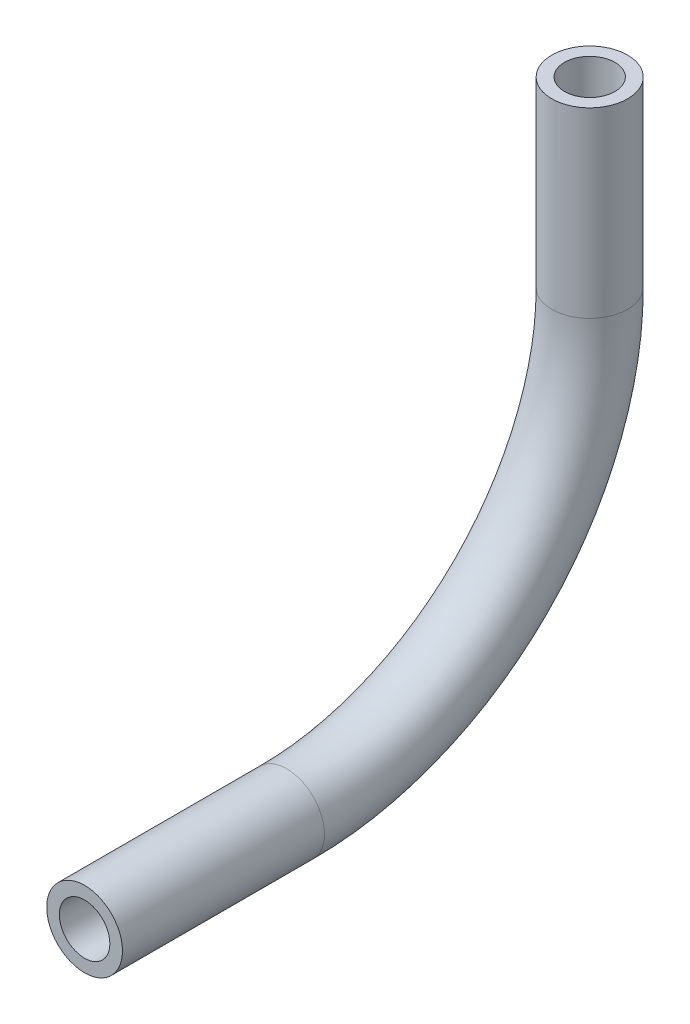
from build123d import *

# Parameters (mm, degrees)
SKETCH1_R   = 9.525
SKETCH1_R_2 = 6.35


with BuildPart() as part:
    # Sweep1: sweep along a path in Sketch2
    with BuildLine(Plane(origin=(0, 0, 0), x_dir=(0, 0, -1), z_dir=(1, 0, 0))) as sweep1_path:
        Line((0, 0), (50.8, 0))
        ThreePointArc((50.8, 0), (104.681536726, 22.318463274), (127, 76.2))
        Line((127, 76.2), (127, 122.050616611))
    # Sketch1 → Sweep1 (sweep)
    with BuildSketch(Plane.XY):
        Circle(SKETCH1_R)
        Circle(SKETCH1_R_2, mode=Mode.SUBTRACT)
    sweep(path=sweep1_path.line)


solid = part.part
